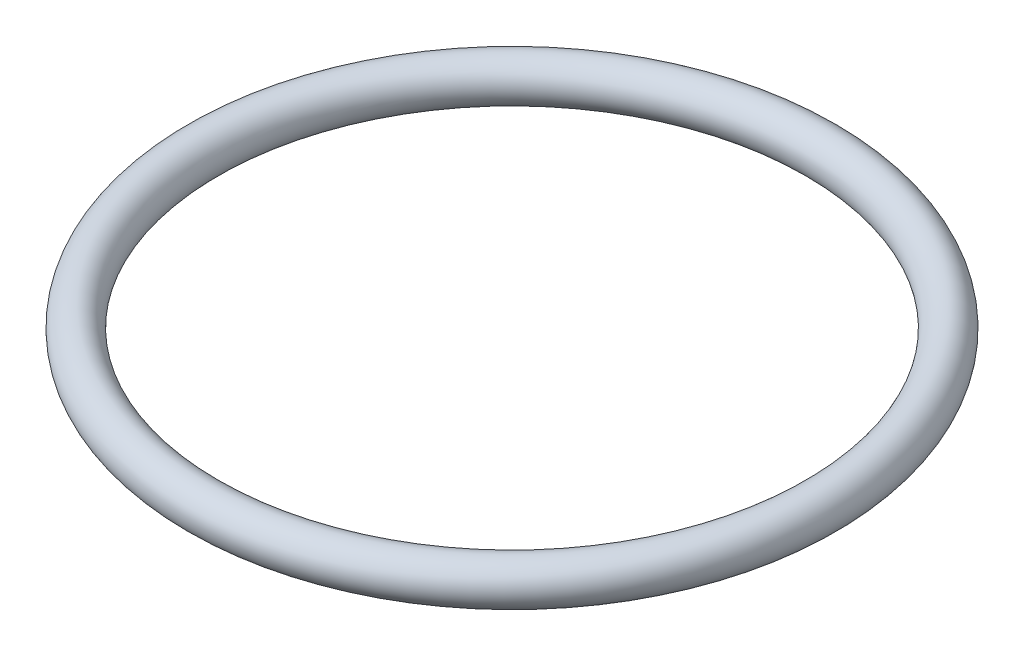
from build123d import *

# Parameters (mm, degrees)
SKETCH3_R = 0.8382


with BuildPart() as part:
    # Sketch3 → Revolve1 (revolve)
    with BuildSketch(Plane(origin=(0, 0, 0), x_dir=(0, 0, -1), z_dir=(1, 0, 0)), mode=Mode.PRIVATE) as revolve1_sk:
        with Locations((-12.2682, 0.8382)):
            Circle(SKETCH3_R)
    revolve(revolve1_sk.sketch.rotate(Axis((0, 0, 0), (0, 1, 0)), 180), axis=Axis((0, 0, 0), (0, 1, 0)))


solid = part.part
